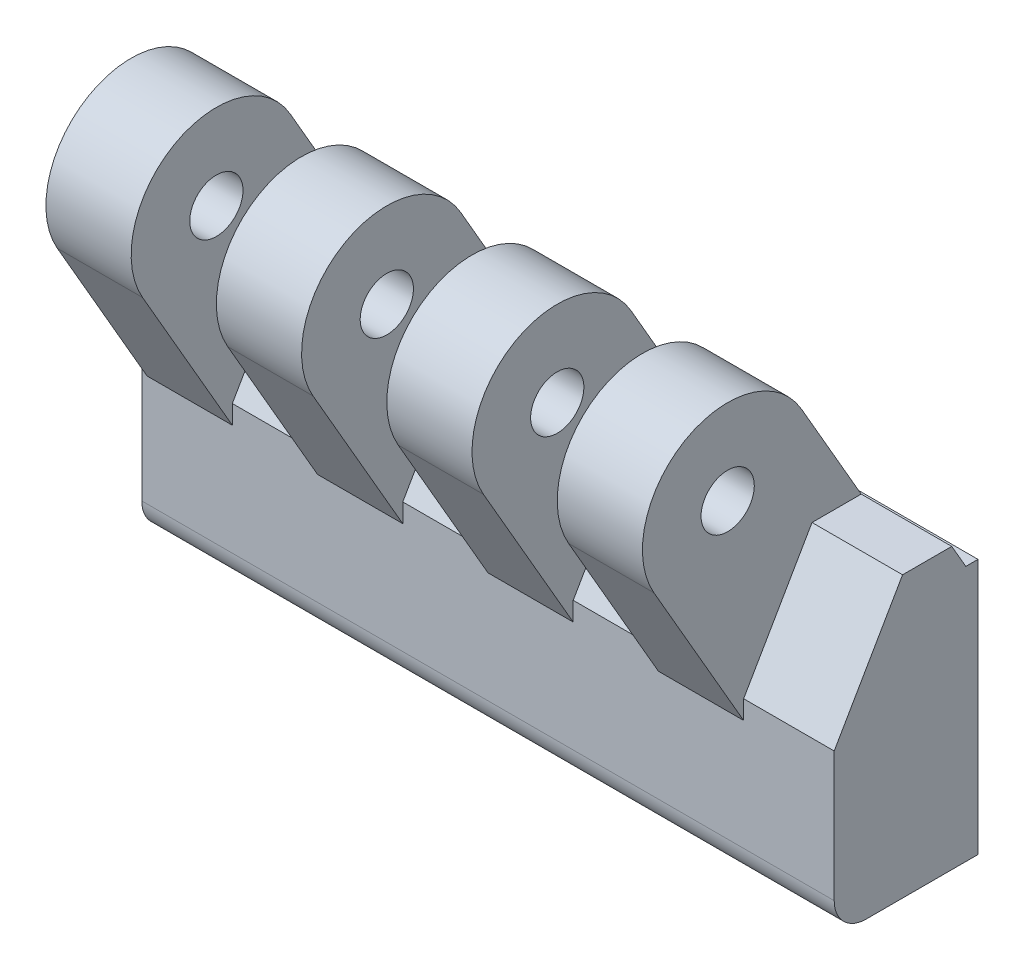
ISO-10303-21;
HEADER;
FILE_DESCRIPTION(('STEP AP214'),'2;1');
FILE_NAME('part.step','',(''),(''),'','','');
FILE_SCHEMA(('AUTOMOTIVE_DESIGN { 1 0 10303 214 1 1 1 1 }'));
ENDSEC;
DATA;
#1=APPLICATION_CONTEXT('core data for automotive mechanical design processes');
#2=APPLICATION_PROTOCOL_DEFINITION('international standard','automotive_design',2000,#1);
#3=PRODUCT_CONTEXT('',#1,'mechanical');
#4=PRODUCT('Part','Part','',(#3));
#5=PRODUCT_RELATED_PRODUCT_CATEGORY('part','',(#4));
#6=PRODUCT_DEFINITION_FORMATION('','',#4);
#7=PRODUCT_DEFINITION_CONTEXT('part definition',#1,'design');
#8=PRODUCT_DEFINITION('design','',#6,#7);
#9=PRODUCT_DEFINITION_SHAPE('','',#8);
#10=(LENGTH_UNIT() NAMED_UNIT(*) SI_UNIT(.MILLI.,.METRE.));
#11=(NAMED_UNIT(*) PLANE_ANGLE_UNIT() SI_UNIT($,.RADIAN.));
#12=(NAMED_UNIT(*) SI_UNIT($,.STERADIAN.) SOLID_ANGLE_UNIT());
#13=UNCERTAINTY_MEASURE_WITH_UNIT(LENGTH_MEASURE(1.E-05),#10,'distance_accuracy_value','');
#14=(GEOMETRIC_REPRESENTATION_CONTEXT(3) GLOBAL_UNCERTAINTY_ASSIGNED_CONTEXT((#13)) GLOBAL_UNIT_ASSIGNED_CONTEXT((#10,
#11,#12)) REPRESENTATION_CONTEXT('',''));
#15=CARTESIAN_POINT('',(0.,0.,0.));
#16=DIRECTION('',(0.,0.,1.));
#17=DIRECTION('',(1.,0.,0.));
#18=AXIS2_PLACEMENT_3D('',#15,#16,#17);
#19=CARTESIAN_POINT('',(-12.5,14.2857142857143,2.4632512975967));
#20=DIRECTION('',(0.,1.,0.));
#21=DIRECTION('',(-1.,0.,0.));
#22=AXIS2_PLACEMENT_3D('',#19,#20,#21);
#23=PLANE('',#22);
#24=DIRECTION('',(1.,0.,0.));
#25=VECTOR('',#24,1.);
#26=CARTESIAN_POINT('',(-12.5,14.2857142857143,7.0820534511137));
#27=LINE('',#26,#25);
#28=CARTESIAN_POINT('',(28.,14.2857142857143,7.0820534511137));
#29=VERTEX_POINT('',#28);
#30=CARTESIAN_POINT('',(36.,14.2857142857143,7.0820534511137));
#31=VERTEX_POINT('',#30);
#32=EDGE_CURVE('E471',#29,#31,#27,.T.);
#33=ORIENTED_EDGE('',*,*,#32,.T.);
#34=DIRECTION('',(0.,0.,-1.));
#35=VECTOR('',#34,1.);
#36=CARTESIAN_POINT('',(36.,14.2857142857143,2.4632512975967));
#37=LINE('',#36,#35);
#38=CARTESIAN_POINT('',(36.,14.2857142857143,2.46325129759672));
#39=VERTEX_POINT('',#38);
#40=EDGE_CURVE('E29',#31,#39,#37,.T.);
#41=ORIENTED_EDGE('',*,*,#40,.T.);
#42=DIRECTION('',(1.,0.,0.));
#43=VECTOR('',#42,1.);
#44=CARTESIAN_POINT('',(-12.5,14.2857142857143,2.4632512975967));
#45=LINE('',#44,#43);
#46=CARTESIAN_POINT('',(28.,14.2857142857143,2.46325129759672));
#47=VERTEX_POINT('',#46);
#48=EDGE_CURVE('E232',#47,#39,#45,.T.);
#49=ORIENTED_EDGE('',*,*,#48,.F.);
#50=DIRECTION('',(0.,0.,-1.));
#51=VECTOR('',#50,1.);
#52=CARTESIAN_POINT('',(28.,14.2857142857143,2.4632512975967));
#53=LINE('',#52,#51);
#54=EDGE_CURVE('E405',#29,#47,#53,.T.);
#55=ORIENTED_EDGE('',*,*,#54,.F.);
#56=EDGE_LOOP('',(#33,#41,#49,#55));
#57=FACE_BOUND('',#56,.T.);
#58=ADVANCED_FACE('F14',(#57),#23,.T.);
#59=CARTESIAN_POINT('',(-12.5,14.2857142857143,7.0820534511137));
#60=DIRECTION('',(0.,0.5,0.866025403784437));
#61=DIRECTION('',(0.,-0.866025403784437,0.5));
#62=AXIS2_PLACEMENT_3D('',#59,#60,#61);
#63=PLANE('',#62);
#64=DIRECTION('',(1.,0.,0.));
#65=VECTOR('',#64,1.);
#66=CARTESIAN_POINT('',(-12.5,3.169504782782,13.5));
#67=LINE('',#66,#65);
#68=CARTESIAN_POINT('',(28.,3.169504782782,13.5));
#69=VERTEX_POINT('',#68);
#70=CARTESIAN_POINT('',(36.,3.169504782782,13.5));
#71=VERTEX_POINT('',#70);
#72=EDGE_CURVE('E465',#69,#71,#67,.T.);
#73=ORIENTED_EDGE('',*,*,#72,.T.);
#74=DIRECTION('',(0.,0.866025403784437,-0.5));
#75=VECTOR('',#74,1.);
#76=CARTESIAN_POINT('',(36.,14.2857142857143,7.0820534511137));
#77=LINE('',#76,#75);
#78=EDGE_CURVE('E502',#71,#31,#77,.T.);
#79=ORIENTED_EDGE('',*,*,#78,.T.);
#80=ORIENTED_EDGE('',*,*,#32,.F.);
#81=DIRECTION('',(0.,0.866025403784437,-0.5));
#82=VECTOR('',#81,1.);
#83=CARTESIAN_POINT('',(28.,14.2857142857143,7.0820534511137));
#84=LINE('',#83,#82);
#85=EDGE_CURVE('E403',#69,#29,#84,.T.);
#86=ORIENTED_EDGE('',*,*,#85,.F.);
#87=EDGE_LOOP('',(#73,#79,#80,#86));
#88=FACE_BOUND('',#87,.T.);
#89=ADVANCED_FACE('F616',(#88),#63,.T.);
#90=CARTESIAN_POINT('',(-12.5,14.2857142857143,7.0820534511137));
#91=VERTEX_POINT('',#90);
#92=CARTESIAN_POINT('',(-12.,14.2857142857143,7.0820534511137));
#93=VERTEX_POINT('',#92);
#94=EDGE_CURVE('E466',#91,#93,#27,.T.);
#95=ORIENTED_EDGE('',*,*,#94,.T.);
#96=DIRECTION('',(0.,0.,-1.));
#97=VECTOR('',#96,1.);
#98=CARTESIAN_POINT('',(-12.,14.2857142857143,2.4632512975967));
#99=LINE('',#98,#97);
#100=CARTESIAN_POINT('',(-12.,14.2857142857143,2.4632512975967));
#101=VERTEX_POINT('',#100);
#102=EDGE_CURVE('E322',#93,#101,#99,.T.);
#103=ORIENTED_EDGE('',*,*,#102,.T.);
#104=CARTESIAN_POINT('',(-12.5,14.2857142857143,2.4632512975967));
#105=VERTEX_POINT('',#104);
#106=EDGE_CURVE('E472',#105,#101,#45,.T.);
#107=ORIENTED_EDGE('',*,*,#106,.F.);
#108=DIRECTION('',(0.,0.,1.));
#109=VECTOR('',#108,1.);
#110=CARTESIAN_POINT('',(-12.5,14.2857142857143,2.4632512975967));
#111=LINE('',#110,#109);
#112=EDGE_CURVE('E441',#105,#91,#111,.T.);
#113=ORIENTED_EDGE('',*,*,#112,.T.);
#114=EDGE_LOOP('',(#95,#103,#107,#113));
#115=FACE_BOUND('',#114,.T.);
#116=ADVANCED_FACE('F600',(#115),#23,.T.);
#117=CARTESIAN_POINT('',(-12.5,3.169504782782,13.5));
#118=VERTEX_POINT('',#117);
#119=CARTESIAN_POINT('',(-12.,3.169504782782,13.5));
#120=VERTEX_POINT('',#119);
#121=EDGE_CURVE('E460',#118,#120,#67,.T.);
#122=ORIENTED_EDGE('',*,*,#121,.T.);
#123=DIRECTION('',(0.,0.866025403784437,-0.5));
#124=VECTOR('',#123,1.);
#125=CARTESIAN_POINT('',(-12.,14.2857142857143,7.0820534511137));
#126=LINE('',#125,#124);
#127=EDGE_CURVE('E320',#120,#93,#126,.T.);
#128=ORIENTED_EDGE('',*,*,#127,.T.);
#129=ORIENTED_EDGE('',*,*,#94,.F.);
#130=DIRECTION('',(0.,-0.866025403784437,0.5));
#131=VECTOR('',#130,1.);
#132=CARTESIAN_POINT('',(-12.5,14.2857142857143,7.0820534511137));
#133=LINE('',#132,#131);
#134=EDGE_CURVE('E444',#91,#118,#133,.T.);
#135=ORIENTED_EDGE('',*,*,#134,.T.);
#136=EDGE_LOOP('',(#122,#128,#129,#135));
#137=FACE_BOUND('',#136,.T.);
#138=ADVANCED_FACE('F598',(#137),#63,.T.);
#139=CARTESIAN_POINT('',(-12.5,3.169504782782,13.5));
#140=DIRECTION('',(0.,0.,1.));
#141=DIRECTION('',(1.,0.,0.));
#142=AXIS2_PLACEMENT_3D('',#139,#140,#141);
#143=PLANE('',#142);
#144=DIRECTION('',(0.,1.,0.));
#145=VECTOR('',#144,1.);
#146=CARTESIAN_POINT('',(44.,3.169504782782,13.5));
#147=LINE('',#146,#145);
#148=CARTESIAN_POINT('',(44.,1.4019237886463,13.5));
#149=VERTEX_POINT('',#148);
#150=CARTESIAN_POINT('',(44.,3.169504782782,13.5));
#151=VERTEX_POINT('',#150);
#152=EDGE_CURVE('E278',#149,#151,#147,.T.);
#153=ORIENTED_EDGE('',*,*,#152,.F.);
#154=DIRECTION('',(-1.,0.,0.));
#155=VECTOR('',#154,1.);
#156=CARTESIAN_POINT('',(-12.5,1.4019237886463,13.5));
#157=LINE('',#156,#155);
#158=CARTESIAN_POINT('',(36.,1.4019237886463,13.5));
#159=VERTEX_POINT('',#158);
#160=EDGE_CURVE('E9',#149,#159,#157,.T.);
#161=ORIENTED_EDGE('',*,*,#160,.T.);
#162=DIRECTION('',(0.,1.,0.));
#163=VECTOR('',#162,1.);
#164=CARTESIAN_POINT('',(36.,3.169504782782,13.5));
#165=LINE('',#164,#163);
#166=EDGE_CURVE('E273',#159,#71,#165,.T.);
#167=ORIENTED_EDGE('',*,*,#166,.T.);
#168=ORIENTED_EDGE('',*,*,#72,.F.);
#169=DIRECTION('',(0.,1.,0.));
#170=VECTOR('',#169,1.);
#171=CARTESIAN_POINT('',(28.,3.169504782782,13.5));
#172=LINE('',#171,#170);
#173=CARTESIAN_POINT('',(28.,1.4019237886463,13.5));
#174=VERTEX_POINT('',#173);
#175=EDGE_CURVE('E488',#174,#69,#172,.T.);
#176=ORIENTED_EDGE('',*,*,#175,.F.);
#177=DIRECTION('',(-1.,0.,0.));
#178=VECTOR('',#177,1.);
#179=CARTESIAN_POINT('',(-12.5,1.4019237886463,13.5));
#180=LINE('',#179,#178);
#181=CARTESIAN_POINT('',(20.,1.4019237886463,13.5));
#182=VERTEX_POINT('',#181);
#183=EDGE_CURVE('E485',#174,#182,#180,.T.);
#184=ORIENTED_EDGE('',*,*,#183,.T.);
#185=DIRECTION('',(0.,1.,0.));
#186=VECTOR('',#185,1.);
#187=CARTESIAN_POINT('',(20.,3.169504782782,13.5));
#188=LINE('',#187,#186);
#189=CARTESIAN_POINT('',(20.,3.169504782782,13.5));
#190=VERTEX_POINT('',#189);
#191=EDGE_CURVE('E482',#182,#190,#188,.T.);
#192=ORIENTED_EDGE('',*,*,#191,.T.);
#193=CARTESIAN_POINT('',(12.,3.169504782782,13.5));
#194=VERTEX_POINT('',#193);
#195=EDGE_CURVE('E533',#194,#190,#67,.T.);
#196=ORIENTED_EDGE('',*,*,#195,.F.);
#197=DIRECTION('',(0.,1.,0.));
#198=VECTOR('',#197,1.);
#199=CARTESIAN_POINT('',(12.,3.169504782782,13.5));
#200=LINE('',#199,#198);
#201=CARTESIAN_POINT('',(12.,1.4019237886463,13.5));
#202=VERTEX_POINT('',#201);
#203=EDGE_CURVE('E490',#202,#194,#200,.T.);
#204=ORIENTED_EDGE('',*,*,#203,.F.);
#205=DIRECTION('',(1.,0.,0.));
#206=VECTOR('',#205,1.);
#207=CARTESIAN_POINT('',(-12.5,1.4019237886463,13.5));
#208=LINE('',#207,#206);
#209=CARTESIAN_POINT('',(4.,1.4019237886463,13.5));
#210=VERTEX_POINT('',#209);
#211=EDGE_CURVE('E493',#210,#202,#208,.T.);
#212=ORIENTED_EDGE('',*,*,#211,.F.);
#213=DIRECTION('',(0.,1.,0.));
#214=VECTOR('',#213,1.);
#215=CARTESIAN_POINT('',(4.,3.169504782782,13.5));
#216=LINE('',#215,#214);
#217=CARTESIAN_POINT('',(4.,3.169504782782,13.5));
#218=VERTEX_POINT('',#217);
#219=EDGE_CURVE('E496',#210,#218,#216,.T.);
#220=ORIENTED_EDGE('',*,*,#219,.T.);
#221=CARTESIAN_POINT('',(-4.,3.169504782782,13.5));
#222=VERTEX_POINT('',#221);
#223=EDGE_CURVE('E464',#222,#218,#67,.T.);
#224=ORIENTED_EDGE('',*,*,#223,.F.);
#225=DIRECTION('',(0.,1.,0.));
#226=VECTOR('',#225,1.);
#227=CARTESIAN_POINT('',(-4.,3.169504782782,13.5));
#228=LINE('',#227,#226);
#229=CARTESIAN_POINT('',(-4.,1.4019237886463,13.5));
#230=VERTEX_POINT('',#229);
#231=EDGE_CURVE('E311',#230,#222,#228,.T.);
#232=ORIENTED_EDGE('',*,*,#231,.F.);
#233=DIRECTION('',(1.,0.,0.));
#234=VECTOR('',#233,1.);
#235=CARTESIAN_POINT('',(-12.5,1.4019237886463,13.5));
#236=LINE('',#235,#234);
#237=CARTESIAN_POINT('',(-12.,1.4019237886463,13.5));
#238=VERTEX_POINT('',#237);
#239=EDGE_CURVE('E499',#238,#230,#236,.T.);
#240=ORIENTED_EDGE('',*,*,#239,.F.);
#241=DIRECTION('',(0.,1.,0.));
#242=VECTOR('',#241,1.);
#243=CARTESIAN_POINT('',(-12.,3.169504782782,13.5));
#244=LINE('',#243,#242);
#245=EDGE_CURVE('E318',#238,#120,#244,.T.);
#246=ORIENTED_EDGE('',*,*,#245,.T.);
#247=ORIENTED_EDGE('',*,*,#121,.F.);
#248=DIRECTION('',(0.,-1.,0.));
#249=VECTOR('',#248,1.);
#250=CARTESIAN_POINT('',(-12.5,3.169504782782,13.5));
#251=LINE('',#250,#249);
#252=CARTESIAN_POINT('',(-12.5,-9.,13.5));
#253=VERTEX_POINT('',#252);
#254=EDGE_CURVE('E447',#118,#253,#251,.T.);
#255=ORIENTED_EDGE('',*,*,#254,.T.);
#256=DIRECTION('',(1.,0.,0.));
#257=VECTOR('',#256,1.);
#258=CARTESIAN_POINT('',(-12.5,-9.,13.5));
#259=LINE('',#258,#257);
#260=CARTESIAN_POINT('',(52.5,-9.,13.5));
#261=VERTEX_POINT('',#260);
#262=EDGE_CURVE('E457',#253,#261,#259,.T.);
#263=ORIENTED_EDGE('',*,*,#262,.T.);
#264=DIRECTION('',(0.,-1.,0.));
#265=VECTOR('',#264,1.);
#266=CARTESIAN_POINT('',(52.5,3.169504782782,13.5));
#267=LINE('',#266,#265);
#268=CARTESIAN_POINT('',(52.5,3.169504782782,13.5));
#269=VERTEX_POINT('',#268);
#270=EDGE_CURVE('E423',#269,#261,#267,.T.);
#271=ORIENTED_EDGE('',*,*,#270,.F.);
#272=EDGE_CURVE('E459',#151,#269,#67,.T.);
#273=ORIENTED_EDGE('',*,*,#272,.F.);
#274=EDGE_LOOP('',(#153,#161,#167,#168,#176,#184,#192,#196,#204,#212,#220,#224,#232,#240,#246,
#247,#255,#263,#271,#273));
#275=FACE_BOUND('',#274,.T.);
#276=ADVANCED_FACE('F543',(#275),#143,.T.);
#277=DIRECTION('',(0.,0.,-1.));
#278=VECTOR('',#277,1.);
#279=CARTESIAN_POINT('',(-4.,14.2857142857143,2.4632512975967));
#280=LINE('',#279,#278);
#281=CARTESIAN_POINT('',(-4.,14.2857142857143,7.0820534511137));
#282=VERTEX_POINT('',#281);
#283=CARTESIAN_POINT('',(-4.,14.2857142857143,2.4632512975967));
#284=VERTEX_POINT('',#283);
#285=EDGE_CURVE('E37',#282,#284,#280,.T.);
#286=ORIENTED_EDGE('',*,*,#285,.F.);
#287=CARTESIAN_POINT('',(4.,14.2857142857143,7.0820534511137));
#288=VERTEX_POINT('',#287);
#289=EDGE_CURVE('E470',#282,#288,#27,.T.);
#290=ORIENTED_EDGE('',*,*,#289,.T.);
#291=DIRECTION('',(0.,0.,-1.));
#292=VECTOR('',#291,1.);
#293=CARTESIAN_POINT('',(4.,14.2857142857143,2.4632512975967));
#294=LINE('',#293,#292);
#295=CARTESIAN_POINT('',(4.,14.2857142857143,2.4632512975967));
#296=VERTEX_POINT('',#295);
#297=EDGE_CURVE('E364',#288,#296,#294,.T.);
#298=ORIENTED_EDGE('',*,*,#297,.T.);
#299=EDGE_CURVE('E476',#284,#296,#45,.T.);
#300=ORIENTED_EDGE('',*,*,#299,.F.);
#301=EDGE_LOOP('',(#286,#290,#298,#300));
#302=FACE_BOUND('',#301,.T.);
#303=ADVANCED_FACE('F626',(#302),#23,.T.);
#304=DIRECTION('',(0.,0.866025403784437,-0.5));
#305=VECTOR('',#304,1.);
#306=CARTESIAN_POINT('',(-4.,14.2857142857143,7.0820534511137));
#307=LINE('',#306,#305);
#308=EDGE_CURVE('E314',#222,#282,#307,.T.);
#309=ORIENTED_EDGE('',*,*,#308,.F.);
#310=ORIENTED_EDGE('',*,*,#223,.T.);
#311=DIRECTION('',(0.,0.866025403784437,-0.5));
#312=VECTOR('',#311,1.);
#313=CARTESIAN_POINT('',(4.,14.2857142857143,7.0820534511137));
#314=LINE('',#313,#312);
#315=EDGE_CURVE('E361',#218,#288,#314,.T.);
#316=ORIENTED_EDGE('',*,*,#315,.T.);
#317=ORIENTED_EDGE('',*,*,#289,.F.);
#318=EDGE_LOOP('',(#309,#310,#316,#317));
#319=FACE_BOUND('',#318,.T.);
#320=ADVANCED_FACE('F581',(#319),#63,.T.);
#321=DIRECTION('',(0.,0.,-1.));
#322=VECTOR('',#321,1.);
#323=CARTESIAN_POINT('',(12.,14.2857142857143,2.4632512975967));
#324=LINE('',#323,#322);
#325=CARTESIAN_POINT('',(12.,14.2857142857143,7.0820534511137));
#326=VERTEX_POINT('',#325);
#327=CARTESIAN_POINT('',(12.,14.2857142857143,2.4632512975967));
#328=VERTEX_POINT('',#327);
#329=EDGE_CURVE('E358',#326,#328,#324,.T.);
#330=ORIENTED_EDGE('',*,*,#329,.F.);
#331=CARTESIAN_POINT('',(20.,14.2857142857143,7.0820534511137));
#332=VERTEX_POINT('',#331);
#333=EDGE_CURVE('E519',#326,#332,#27,.T.);
#334=ORIENTED_EDGE('',*,*,#333,.T.);
#335=DIRECTION('',(0.,0.,-1.));
#336=VECTOR('',#335,1.);
#337=CARTESIAN_POINT('',(20.,14.2857142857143,2.4632512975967));
#338=LINE('',#337,#336);
#339=CARTESIAN_POINT('',(20.,14.2857142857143,2.46325129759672));
#340=VERTEX_POINT('',#339);
#341=EDGE_CURVE('E400',#332,#340,#338,.T.);
#342=ORIENTED_EDGE('',*,*,#341,.T.);
#343=EDGE_CURVE('E561',#328,#340,#45,.T.);
#344=ORIENTED_EDGE('',*,*,#343,.F.);
#345=EDGE_LOOP('',(#330,#334,#342,#344));
#346=FACE_BOUND('',#345,.T.);
#347=ADVANCED_FACE('F523',(#346),#23,.T.);
#348=DIRECTION('',(0.,0.866025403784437,-0.5));
#349=VECTOR('',#348,1.);
#350=CARTESIAN_POINT('',(12.,14.2857142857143,7.0820534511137));
#351=LINE('',#350,#349);
#352=EDGE_CURVE('E355',#194,#326,#351,.T.);
#353=ORIENTED_EDGE('',*,*,#352,.F.);
#354=ORIENTED_EDGE('',*,*,#195,.T.);
#355=DIRECTION('',(0.,0.866025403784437,-0.5));
#356=VECTOR('',#355,1.);
#357=CARTESIAN_POINT('',(20.,14.2857142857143,7.0820534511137));
#358=LINE('',#357,#356);
#359=EDGE_CURVE('E397',#190,#332,#358,.T.);
#360=ORIENTED_EDGE('',*,*,#359,.T.);
#361=ORIENTED_EDGE('',*,*,#333,.F.);
#362=EDGE_LOOP('',(#353,#354,#360,#361));
#363=FACE_BOUND('',#362,.T.);
#364=ADVANCED_FACE('F532',(#363),#63,.T.);
#365=CARTESIAN_POINT('',(-12.5,-12.,10.5));
#366=DIRECTION('',(0.,-1.,0.));
#367=DIRECTION('',(1.,0.,0.));
#368=AXIS2_PLACEMENT_3D('',#365,#366,#367);
#369=PLANE('',#368);
#370=DIRECTION('',(1.,0.,0.));
#371=VECTOR('',#370,1.);
#372=CARTESIAN_POINT('',(-12.5,-12.,0.));
#373=LINE('',#372,#371);
#374=CARTESIAN_POINT('',(-12.5,-12.,0.));
#375=VERTEX_POINT('',#374);
#376=CARTESIAN_POINT('',(52.5,-12.,0.));
#377=VERTEX_POINT('',#376);
#378=EDGE_CURVE('E480',#375,#377,#373,.T.);
#379=ORIENTED_EDGE('',*,*,#378,.T.);
#380=DIRECTION('',(0.,0.,-1.));
#381=VECTOR('',#380,1.);
#382=CARTESIAN_POINT('',(52.5,-12.,10.5));
#383=LINE('',#382,#381);
#384=CARTESIAN_POINT('',(52.5,-12.,10.5));
#385=VERTEX_POINT('',#384);
#386=EDGE_CURVE('E407',#385,#377,#383,.T.);
#387=ORIENTED_EDGE('',*,*,#386,.F.);
#388=DIRECTION('',(1.,0.,0.));
#389=VECTOR('',#388,1.);
#390=CARTESIAN_POINT('',(-12.5,-12.,10.5));
#391=LINE('',#390,#389);
#392=CARTESIAN_POINT('',(-12.5,-12.,10.5));
#393=VERTEX_POINT('',#392);
#394=EDGE_CURVE('E453',#393,#385,#391,.T.);
#395=ORIENTED_EDGE('',*,*,#394,.F.);
#396=DIRECTION('',(0.,0.,-1.));
#397=VECTOR('',#396,1.);
#398=CARTESIAN_POINT('',(-12.5,-12.,10.5));
#399=LINE('',#398,#397);
#400=EDGE_CURVE('E429',#393,#375,#399,.T.);
#401=ORIENTED_EDGE('',*,*,#400,.T.);
#402=EDGE_LOOP('',(#379,#387,#395,#401));
#403=FACE_BOUND('',#402,.T.);
#404=ADVANCED_FACE('F16',(#403),#369,.T.);
#405=CARTESIAN_POINT('',(-12.5,-12.,0.));
#406=DIRECTION('',(0.,0.,-1.));
#407=DIRECTION('',(-1.,0.,0.));
#408=AXIS2_PLACEMENT_3D('',#405,#406,#407);
#409=PLANE('',#408);
#410=CARTESIAN_POINT('',(0.,0.,0.));
#411=DIRECTION('',(0.,0.,-1.));
#412=DIRECTION('',(-1.,0.,0.));
#413=AXIS2_PLACEMENT_3D('',#410,#411,#412);
#414=CIRCLE('',#413,3.);
#415=CARTESIAN_POINT('',(-3.,0.,0.));
#416=VERTEX_POINT('',#415);
#417=EDGE_CURVE('E1347',#416,#416,#414,.T.);
#418=ORIENTED_EDGE('',*,*,#417,.F.);
#419=EDGE_LOOP('',(#418));
#420=FACE_BOUND('',#419,.T.);
#421=CARTESIAN_POINT('',(40.,0.,0.));
#422=DIRECTION('',(0.,0.,-1.));
#423=DIRECTION('',(-1.,0.,0.));
#424=AXIS2_PLACEMENT_3D('',#421,#422,#423);
#425=CIRCLE('',#424,3.);
#426=CARTESIAN_POINT('',(37.,0.,0.));
#427=VERTEX_POINT('',#426);
#428=EDGE_CURVE('E1350',#427,#427,#425,.T.);
#429=ORIENTED_EDGE('',*,*,#428,.F.);
#430=EDGE_LOOP('',(#429));
#431=FACE_BOUND('',#430,.T.);
#432=DIRECTION('',(1.,0.,0.));
#433=VECTOR('',#432,1.);
#434=CARTESIAN_POINT('',(-12.5,12.,0.));
#435=LINE('',#434,#433);
#436=CARTESIAN_POINT('',(-12.5,12.,0.));
#437=VERTEX_POINT('',#436);
#438=CARTESIAN_POINT('',(52.5,12.,0.));
#439=VERTEX_POINT('',#438);
#440=EDGE_CURVE('E478',#437,#439,#435,.T.);
#441=ORIENTED_EDGE('',*,*,#440,.T.);
#442=DIRECTION('',(0.,1.,0.));
#443=VECTOR('',#442,1.);
#444=CARTESIAN_POINT('',(52.5,-12.,0.));
#445=LINE('',#444,#443);
#446=EDGE_CURVE('E408',#377,#439,#445,.T.);
#447=ORIENTED_EDGE('',*,*,#446,.F.);
#448=ORIENTED_EDGE('',*,*,#378,.F.);
#449=DIRECTION('',(0.,1.,0.));
#450=VECTOR('',#449,1.);
#451=CARTESIAN_POINT('',(-12.5,-12.,0.));
#452=LINE('',#451,#450);
#453=EDGE_CURVE('E432',#375,#437,#452,.T.);
#454=ORIENTED_EDGE('',*,*,#453,.T.);
#455=EDGE_LOOP('',(#441,#447,#448,#454));
#456=FACE_BOUND('',#455,.T.);
#457=ADVANCED_FACE('F554',(#420,#431,#456),#409,.T.);
#458=CARTESIAN_POINT('',(-12.5,12.,0.));
#459=DIRECTION('',(0.,1.,0.));
#460=DIRECTION('',(-1.,0.,0.));
#461=AXIS2_PLACEMENT_3D('',#458,#459,#460);
#462=PLANE('',#461);
#463=DIRECTION('',(1.,0.,0.));
#464=VECTOR('',#463,1.);
#465=CARTESIAN_POINT('',(-12.5,12.,1.143593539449));
#466=LINE('',#465,#464);
#467=CARTESIAN_POINT('',(-12.5,12.,1.143593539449));
#468=VERTEX_POINT('',#467);
#469=CARTESIAN_POINT('',(52.5,12.,1.143593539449));
#470=VERTEX_POINT('',#469);
#471=EDGE_CURVE('E475',#468,#470,#466,.T.);
#472=ORIENTED_EDGE('',*,*,#471,.T.);
#473=DIRECTION('',(0.,0.,1.));
#474=VECTOR('',#473,1.);
#475=CARTESIAN_POINT('',(52.5,12.,0.));
#476=LINE('',#475,#474);
#477=EDGE_CURVE('E411',#439,#470,#476,.T.);
#478=ORIENTED_EDGE('',*,*,#477,.F.);
#479=ORIENTED_EDGE('',*,*,#440,.F.);
#480=DIRECTION('',(0.,0.,1.));
#481=VECTOR('',#480,1.);
#482=CARTESIAN_POINT('',(-12.5,12.,0.));
#483=LINE('',#482,#481);
#484=EDGE_CURVE('E435',#437,#468,#483,.T.);
#485=ORIENTED_EDGE('',*,*,#484,.T.);
#486=EDGE_LOOP('',(#472,#478,#479,#485));
#487=FACE_BOUND('',#486,.T.);
#488=ADVANCED_FACE('F557',(#487),#462,.T.);
#489=CARTESIAN_POINT('',(-12.5,12.,1.143593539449));
#490=DIRECTION('',(0.,0.499999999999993,-0.866025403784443));
#491=DIRECTION('',(0.,0.866025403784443,0.499999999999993));
#492=AXIS2_PLACEMENT_3D('',#489,#490,#491);
#493=PLANE('',#492);
#494=DIRECTION('',(0.,0.866025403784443,0.499999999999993));
#495=VECTOR('',#494,1.);
#496=CARTESIAN_POINT('',(52.5,12.,1.143593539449));
#497=LINE('',#496,#495);
#498=CARTESIAN_POINT('',(52.5,14.2857142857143,2.4632512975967));
#499=VERTEX_POINT('',#498);
#500=EDGE_CURVE('E414',#470,#499,#497,.T.);
#501=ORIENTED_EDGE('',*,*,#500,.F.);
#502=ORIENTED_EDGE('',*,*,#471,.F.);
#503=DIRECTION('',(0.,0.866025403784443,0.499999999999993));
#504=VECTOR('',#503,1.);
#505=CARTESIAN_POINT('',(-12.5,12.,1.143593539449));
#506=LINE('',#505,#504);
#507=EDGE_CURVE('E438',#468,#105,#506,.T.);
#508=ORIENTED_EDGE('',*,*,#507,.T.);
#509=ORIENTED_EDGE('',*,*,#106,.T.);
#510=DIRECTION('',(0.,0.866025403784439,0.5));
#511=VECTOR('',#510,1.);
#512=CARTESIAN_POINT('',(-12.,11.7512886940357,1.));
#513=LINE('',#512,#511);
#514=CARTESIAN_POINT('',(-12.,24.,8.0717967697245));
#515=VERTEX_POINT('',#514);
#516=EDGE_CURVE('E296',#101,#515,#513,.T.);
#517=ORIENTED_EDGE('',*,*,#516,.T.);
#518=DIRECTION('',(1.,0.,0.));
#519=VECTOR('',#518,1.);
#520=CARTESIAN_POINT('',(-12.,24.,8.0717967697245));
#521=LINE('',#520,#519);
#522=CARTESIAN_POINT('',(-4.,24.,8.0717967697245));
#523=VERTEX_POINT('',#522);
#524=EDGE_CURVE('E308',#515,#523,#521,.T.);
#525=ORIENTED_EDGE('',*,*,#524,.T.);
#526=DIRECTION('',(0.,0.866025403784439,0.5));
#527=VECTOR('',#526,1.);
#528=CARTESIAN_POINT('',(-4.,11.7512886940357,1.));
#529=LINE('',#528,#527);
#530=EDGE_CURVE('E281',#284,#523,#529,.T.);
#531=ORIENTED_EDGE('',*,*,#530,.F.);
#532=ORIENTED_EDGE('',*,*,#299,.T.);
#533=DIRECTION('',(0.,0.866025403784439,0.5));
#534=VECTOR('',#533,1.);
#535=CARTESIAN_POINT('',(4.,11.7512886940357,1.));
#536=LINE('',#535,#534);
#537=CARTESIAN_POINT('',(4.,24.,8.0717967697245));
#538=VERTEX_POINT('',#537);
#539=EDGE_CURVE('E340',#296,#538,#536,.T.);
#540=ORIENTED_EDGE('',*,*,#539,.T.);
#541=DIRECTION('',(1.,0.,0.));
#542=VECTOR('',#541,1.);
#543=CARTESIAN_POINT('',(4.,24.,8.0717967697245));
#544=LINE('',#543,#542);
#545=CARTESIAN_POINT('',(12.,24.,8.0717967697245));
#546=VERTEX_POINT('',#545);
#547=EDGE_CURVE('E352',#538,#546,#544,.T.);
#548=ORIENTED_EDGE('',*,*,#547,.T.);
#549=DIRECTION('',(0.,0.866025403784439,0.5));
#550=VECTOR('',#549,1.);
#551=CARTESIAN_POINT('',(12.,11.7512886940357,1.));
#552=LINE('',#551,#550);
#553=EDGE_CURVE('E325',#328,#546,#552,.T.);
#554=ORIENTED_EDGE('',*,*,#553,.F.);
#555=ORIENTED_EDGE('',*,*,#343,.T.);
#556=DIRECTION('',(0.,0.866025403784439,0.5));
#557=VECTOR('',#556,1.);
#558=CARTESIAN_POINT('',(20.,11.7512886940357,1.));
#559=LINE('',#558,#557);
#560=CARTESIAN_POINT('',(20.,24.,8.0717967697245));
#561=VERTEX_POINT('',#560);
#562=EDGE_CURVE('E368',#340,#561,#559,.T.);
#563=ORIENTED_EDGE('',*,*,#562,.T.);
#564=DIRECTION('',(-1.,0.,0.));
#565=VECTOR('',#564,1.);
#566=CARTESIAN_POINT('',(28.,24.,8.0717967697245));
#567=LINE('',#566,#565);
#568=CARTESIAN_POINT('',(28.,24.,8.0717967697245));
#569=VERTEX_POINT('',#568);
#570=EDGE_CURVE('E394',#569,#561,#567,.T.);
#571=ORIENTED_EDGE('',*,*,#570,.F.);
#572=DIRECTION('',(0.,0.866025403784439,0.5));
#573=VECTOR('',#572,1.);
#574=CARTESIAN_POINT('',(28.,11.7512886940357,1.));
#575=LINE('',#574,#573);
#576=EDGE_CURVE('E382',#47,#569,#575,.T.);
#577=ORIENTED_EDGE('',*,*,#576,.F.);
#578=ORIENTED_EDGE('',*,*,#48,.T.);
#579=DIRECTION('',(0.,0.866025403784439,0.5));
#580=VECTOR('',#579,1.);
#581=CARTESIAN_POINT('',(36.,11.7512886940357,1.));
#582=LINE('',#581,#580);
#583=CARTESIAN_POINT('',(36.,24.,8.0717967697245));
#584=VERTEX_POINT('',#583);
#585=EDGE_CURVE('E223',#39,#584,#582,.T.);
#586=ORIENTED_EDGE('',*,*,#585,.T.);
#587=DIRECTION('',(-1.,0.,0.));
#588=VECTOR('',#587,1.);
#589=CARTESIAN_POINT('',(44.,24.,8.0717967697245));
#590=LINE('',#589,#588);
#591=CARTESIAN_POINT('',(44.,24.,8.0717967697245));
#592=VERTEX_POINT('',#591);
#593=EDGE_CURVE('E228',#592,#584,#590,.T.);
#594=ORIENTED_EDGE('',*,*,#593,.F.);
#595=DIRECTION('',(0.,0.866025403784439,0.5));
#596=VECTOR('',#595,1.);
#597=CARTESIAN_POINT('',(44.,11.7512886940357,1.));
#598=LINE('',#597,#596);
#599=CARTESIAN_POINT('',(44.,14.2857142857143,2.46325129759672));
#600=VERTEX_POINT('',#599);
#601=EDGE_CURVE('E263',#600,#592,#598,.T.);
#602=ORIENTED_EDGE('',*,*,#601,.F.);
#603=EDGE_CURVE('E469',#600,#499,#45,.T.);
#604=ORIENTED_EDGE('',*,*,#603,.T.);
#605=EDGE_LOOP('',(#501,#502,#508,#509,#517,#525,#531,#532,#540,#548,#554,#555,#563,#571,#577,
#578,#586,#594,#602,#604));
#606=FACE_BOUND('',#605,.T.);
#607=ADVANCED_FACE('F226',(#606),#493,.T.);
#608=DIRECTION('',(0.,0.,-1.));
#609=VECTOR('',#608,1.);
#610=CARTESIAN_POINT('',(44.,14.2857142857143,2.4632512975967));
#611=LINE('',#610,#609);
#612=CARTESIAN_POINT('',(44.,14.2857142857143,7.0820534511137));
#613=VERTEX_POINT('',#612);
#614=EDGE_CURVE('E276',#613,#600,#611,.T.);
#615=ORIENTED_EDGE('',*,*,#614,.F.);
#616=CARTESIAN_POINT('',(52.5,14.2857142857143,7.0820534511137));
#617=VERTEX_POINT('',#616);
#618=EDGE_CURVE('E463',#613,#617,#27,.T.);
#619=ORIENTED_EDGE('',*,*,#618,.T.);
#620=DIRECTION('',(0.,0.,1.));
#621=VECTOR('',#620,1.);
#622=CARTESIAN_POINT('',(52.5,14.2857142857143,2.4632512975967));
#623=LINE('',#622,#621);
#624=EDGE_CURVE('E417',#499,#617,#623,.T.);
#625=ORIENTED_EDGE('',*,*,#624,.F.);
#626=ORIENTED_EDGE('',*,*,#603,.F.);
#627=EDGE_LOOP('',(#615,#619,#625,#626));
#628=FACE_BOUND('',#627,.T.);
#629=ADVANCED_FACE('F514',(#628),#23,.T.);
#630=DIRECTION('',(0.,0.866025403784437,-0.5));
#631=VECTOR('',#630,1.);
#632=CARTESIAN_POINT('',(44.,14.2857142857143,7.0820534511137));
#633=LINE('',#632,#631);
#634=EDGE_CURVE('E22',#151,#613,#633,.T.);
#635=ORIENTED_EDGE('',*,*,#634,.F.);
#636=ORIENTED_EDGE('',*,*,#272,.T.);
#637=DIRECTION('',(0.,-0.866025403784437,0.5));
#638=VECTOR('',#637,1.);
#639=CARTESIAN_POINT('',(52.5,14.2857142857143,7.0820534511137));
#640=LINE('',#639,#638);
#641=EDGE_CURVE('E420',#617,#269,#640,.T.);
#642=ORIENTED_EDGE('',*,*,#641,.F.);
#643=ORIENTED_EDGE('',*,*,#618,.F.);
#644=EDGE_LOOP('',(#635,#636,#642,#643));
#645=FACE_BOUND('',#644,.T.);
#646=ADVANCED_FACE('F517',(#645),#63,.T.);
#647=CARTESIAN_POINT('',(-12.5,-9.00000000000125,10.5000000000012));
#648=DIRECTION('',(1.,0.,0.));
#649=DIRECTION('',(0.,1.,0.));
#650=AXIS2_PLACEMENT_3D('',#647,#648,#649);
#651=CYLINDRICAL_SURFACE('',#650,2.99999999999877);
#652=ORIENTED_EDGE('',*,*,#394,.T.);
#653=CARTESIAN_POINT('',(52.5,-9.00000000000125,10.5000000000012));
#654=DIRECTION('',(1.,0.,0.));
#655=DIRECTION('',(0.,1.,0.));
#656=AXIS2_PLACEMENT_3D('',#653,#654,#655);
#657=CIRCLE('',#656,2.99999999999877);
#658=EDGE_CURVE('E426',#261,#385,#657,.T.);
#659=ORIENTED_EDGE('',*,*,#658,.F.);
#660=ORIENTED_EDGE('',*,*,#262,.F.);
#661=CARTESIAN_POINT('',(-12.5,-9.00000000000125,10.5000000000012));
#662=DIRECTION('',(1.,0.,0.));
#663=DIRECTION('',(0.,1.,0.));
#664=AXIS2_PLACEMENT_3D('',#661,#662,#663);
#665=CIRCLE('',#664,2.99999999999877);
#666=EDGE_CURVE('E450',#253,#393,#665,.T.);
#667=ORIENTED_EDGE('',*,*,#666,.T.);
#668=EDGE_LOOP('',(#652,#659,#660,#667));
#669=FACE_BOUND('',#668,.T.);
#670=ADVANCED_FACE('F547',(#669),#651,.T.);
#671=CARTESIAN_POINT('',(-12.5,-9.00000000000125,10.5000000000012));
#672=DIRECTION('',(1.,0.,0.));
#673=DIRECTION('',(0.,1.,0.));
#674=AXIS2_PLACEMENT_3D('',#671,#672,#673);
#675=PLANE('',#674);
#676=ORIENTED_EDGE('',*,*,#400,.F.);
#677=ORIENTED_EDGE('',*,*,#666,.F.);
#678=ORIENTED_EDGE('',*,*,#254,.F.);
#679=ORIENTED_EDGE('',*,*,#134,.F.);
#680=ORIENTED_EDGE('',*,*,#112,.F.);
#681=ORIENTED_EDGE('',*,*,#507,.F.);
#682=ORIENTED_EDGE('',*,*,#484,.F.);
#683=ORIENTED_EDGE('',*,*,#453,.F.);
#684=EDGE_LOOP('',(#676,#677,#678,#679,#680,#681,#682,#683));
#685=FACE_BOUND('',#684,.T.);
#686=ADVANCED_FACE('F603',(#685),#675,.F.);
#687=CARTESIAN_POINT('',(52.5,-9.00000000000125,10.5000000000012));
#688=DIRECTION('',(1.,0.,0.));
#689=DIRECTION('',(0.,1.,0.));
#690=AXIS2_PLACEMENT_3D('',#687,#688,#689);
#691=PLANE('',#690);
#692=ORIENTED_EDGE('',*,*,#386,.T.);
#693=ORIENTED_EDGE('',*,*,#446,.T.);
#694=ORIENTED_EDGE('',*,*,#477,.T.);
#695=ORIENTED_EDGE('',*,*,#500,.T.);
#696=ORIENTED_EDGE('',*,*,#624,.T.);
#697=ORIENTED_EDGE('',*,*,#641,.T.);
#698=ORIENTED_EDGE('',*,*,#270,.T.);
#699=ORIENTED_EDGE('',*,*,#658,.T.);
#700=EDGE_LOOP('',(#692,#693,#694,#695,#696,#697,#698,#699));
#701=FACE_BOUND('',#700,.T.);
#702=ADVANCED_FACE('F541',(#701),#691,.T.);
#703=CARTESIAN_POINT('',(28.,16.,21.928203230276));
#704=DIRECTION('',(0.,0.500000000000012,-0.866025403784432));
#705=DIRECTION('',(0.,0.866025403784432,0.500000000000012));
#706=AXIS2_PLACEMENT_3D('',#703,#704,#705);
#707=PLANE('',#706);
#708=ORIENTED_EDGE('',*,*,#183,.F.);
#709=DIRECTION('',(0.,-0.866025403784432,-0.500000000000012));
#710=VECTOR('',#709,1.);
#711=CARTESIAN_POINT('',(28.,16.,21.928203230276));
#712=LINE('',#711,#710);
#713=CARTESIAN_POINT('',(28.,16.,21.928203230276));
#714=VERTEX_POINT('',#713);
#715=EDGE_CURVE('E381',#714,#174,#712,.T.);
#716=ORIENTED_EDGE('',*,*,#715,.F.);
#717=DIRECTION('',(-1.,0.,0.));
#718=VECTOR('',#717,1.);
#719=CARTESIAN_POINT('',(28.,16.,21.928203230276));
#720=LINE('',#719,#718);
#721=CARTESIAN_POINT('',(20.,16.,21.928203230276));
#722=VERTEX_POINT('',#721);
#723=EDGE_CURVE('E391',#714,#722,#720,.T.);
#724=ORIENTED_EDGE('',*,*,#723,.T.);
#725=DIRECTION('',(0.,-0.866025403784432,-0.500000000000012));
#726=VECTOR('',#725,1.);
#727=CARTESIAN_POINT('',(20.,16.,21.928203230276));
#728=LINE('',#727,#726);
#729=EDGE_CURVE('E367',#722,#182,#728,.T.);
#730=ORIENTED_EDGE('',*,*,#729,.T.);
#731=EDGE_LOOP('',(#708,#716,#724,#730));
#732=FACE_BOUND('',#731,.T.);
#733=ADVANCED_FACE('F612',(#732),#707,.F.);
#734=CARTESIAN_POINT('',(28.,20.,15.));
#735=DIRECTION('',(-1.,0.,0.));
#736=DIRECTION('',(0.,-1.,0.));
#737=AXIS2_PLACEMENT_3D('',#734,#735,#736);
#738=CYLINDRICAL_SURFACE('',#737,2.5);
#739=CARTESIAN_POINT('',(28.,20.,15.));
#740=DIRECTION('',(1.,0.,0.));
#741=DIRECTION('',(0.,1.,0.));
#742=AXIS2_PLACEMENT_3D('',#739,#740,#741);
#743=CIRCLE('',#742,2.5);
#744=CARTESIAN_POINT('',(28.,22.5,15.));
#745=VERTEX_POINT('',#744);
#746=EDGE_CURVE('E386',#745,#745,#743,.T.);
#747=ORIENTED_EDGE('',*,*,#746,.T.);
#748=EDGE_LOOP('',(#747));
#749=FACE_BOUND('',#748,.T.);
#750=CARTESIAN_POINT('',(20.,20.,15.));
#751=DIRECTION('',(1.,0.,0.));
#752=DIRECTION('',(0.,1.,0.));
#753=AXIS2_PLACEMENT_3D('',#750,#751,#752);
#754=CIRCLE('',#753,2.5);
#755=CARTESIAN_POINT('',(20.,22.5,15.));
#756=VERTEX_POINT('',#755);
#757=EDGE_CURVE('E374',#756,#756,#754,.T.);
#758=ORIENTED_EDGE('',*,*,#757,.F.);
#759=EDGE_LOOP('',(#758));
#760=FACE_BOUND('',#759,.T.);
#761=ADVANCED_FACE('F718',(#749,#760),#738,.F.);
#762=CARTESIAN_POINT('',(28.,19.9999999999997,15.));
#763=DIRECTION('',(-1.,0.,0.));
#764=DIRECTION('',(0.,-1.,0.));
#765=AXIS2_PLACEMENT_3D('',#762,#763,#764);
#766=CYLINDRICAL_SURFACE('',#765,8.00000000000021);
#767=CARTESIAN_POINT('',(20.,19.9999999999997,15.));
#768=DIRECTION('',(1.,0.,0.));
#769=DIRECTION('',(0.,-1.,0.));
#770=AXIS2_PLACEMENT_3D('',#767,#768,#769);
#771=CIRCLE('',#770,8.00000000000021);
#772=EDGE_CURVE('E371',#561,#722,#771,.T.);
#773=ORIENTED_EDGE('',*,*,#772,.T.);
#774=ORIENTED_EDGE('',*,*,#723,.F.);
#775=CARTESIAN_POINT('',(28.,19.9999999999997,15.));
#776=DIRECTION('',(1.,0.,0.));
#777=DIRECTION('',(0.,-1.,0.));
#778=AXIS2_PLACEMENT_3D('',#775,#776,#777);
#779=CIRCLE('',#778,8.00000000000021);
#780=EDGE_CURVE('E384',#569,#714,#779,.T.);
#781=ORIENTED_EDGE('',*,*,#780,.F.);
#782=ORIENTED_EDGE('',*,*,#570,.T.);
#783=EDGE_LOOP('',(#773,#774,#781,#782));
#784=FACE_BOUND('',#783,.T.);
#785=ADVANCED_FACE('F730',(#784),#766,.T.);
#786=CARTESIAN_POINT('',(28.,19.9999999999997,15.));
#787=DIRECTION('',(1.,0.,0.));
#788=DIRECTION('',(0.,1.,0.));
#789=AXIS2_PLACEMENT_3D('',#786,#787,#788);
#790=PLANE('',#789);
#791=ORIENTED_EDGE('',*,*,#746,.F.);
#792=EDGE_LOOP('',(#791));
#793=FACE_BOUND('',#792,.T.);
#794=ORIENTED_EDGE('',*,*,#85,.T.);
#795=ORIENTED_EDGE('',*,*,#54,.T.);
#796=ORIENTED_EDGE('',*,*,#576,.T.);
#797=ORIENTED_EDGE('',*,*,#780,.T.);
#798=ORIENTED_EDGE('',*,*,#715,.T.);
#799=ORIENTED_EDGE('',*,*,#175,.T.);
#800=EDGE_LOOP('',(#794,#795,#796,#797,#798,#799));
#801=FACE_BOUND('',#800,.T.);
#802=ADVANCED_FACE('F742',(#793,#801),#790,.T.);
#803=CARTESIAN_POINT('',(20.,19.9999999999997,15.));
#804=DIRECTION('',(1.,0.,0.));
#805=DIRECTION('',(0.,1.,0.));
#806=AXIS2_PLACEMENT_3D('',#803,#804,#805);
#807=PLANE('',#806);
#808=ORIENTED_EDGE('',*,*,#341,.F.);
#809=ORIENTED_EDGE('',*,*,#359,.F.);
#810=ORIENTED_EDGE('',*,*,#191,.F.);
#811=ORIENTED_EDGE('',*,*,#729,.F.);
#812=ORIENTED_EDGE('',*,*,#772,.F.);
#813=ORIENTED_EDGE('',*,*,#562,.F.);
#814=EDGE_LOOP('',(#808,#809,#810,#811,#812,#813));
#815=FACE_BOUND('',#814,.T.);
#816=ORIENTED_EDGE('',*,*,#757,.T.);
#817=EDGE_LOOP('',(#816));
#818=FACE_BOUND('',#817,.T.);
#819=ADVANCED_FACE('F529',(#815,#818),#807,.F.);
#820=CARTESIAN_POINT('',(4.,16.,21.928203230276));
#821=DIRECTION('',(0.,-0.500000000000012,0.866025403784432));
#822=DIRECTION('',(0.,-0.866025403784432,-0.500000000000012));
#823=AXIS2_PLACEMENT_3D('',#820,#821,#822);
#824=PLANE('',#823);
#825=DIRECTION('',(0.,-0.866025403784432,-0.500000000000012));
#826=VECTOR('',#825,1.);
#827=CARTESIAN_POINT('',(4.,16.,21.928203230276));
#828=LINE('',#827,#826);
#829=CARTESIAN_POINT('',(4.,16.,21.928203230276));
#830=VERTEX_POINT('',#829);
#831=EDGE_CURVE('E339',#830,#210,#828,.T.);
#832=ORIENTED_EDGE('',*,*,#831,.T.);
#833=ORIENTED_EDGE('',*,*,#211,.T.);
#834=DIRECTION('',(0.,-0.866025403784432,-0.500000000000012));
#835=VECTOR('',#834,1.);
#836=CARTESIAN_POINT('',(12.,16.,21.928203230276));
#837=LINE('',#836,#835);
#838=CARTESIAN_POINT('',(12.,16.,21.928203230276));
#839=VERTEX_POINT('',#838);
#840=EDGE_CURVE('E324',#839,#202,#837,.T.);
#841=ORIENTED_EDGE('',*,*,#840,.F.);
#842=DIRECTION('',(1.,0.,0.));
#843=VECTOR('',#842,1.);
#844=CARTESIAN_POINT('',(4.,16.,21.928203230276));
#845=LINE('',#844,#843);
#846=EDGE_CURVE('E350',#830,#839,#845,.T.);
#847=ORIENTED_EDGE('',*,*,#846,.F.);
#848=EDGE_LOOP('',(#832,#833,#841,#847));
#849=FACE_BOUND('',#848,.T.);
#850=ADVANCED_FACE('F570',(#849),#824,.T.);
#851=CARTESIAN_POINT('',(4.,20.,15.));
#852=DIRECTION('',(1.,0.,0.));
#853=DIRECTION('',(0.,1.,0.));
#854=AXIS2_PLACEMENT_3D('',#851,#852,#853);
#855=CYLINDRICAL_SURFACE('',#854,2.5);
#856=CARTESIAN_POINT('',(4.,20.,15.));
#857=DIRECTION('',(1.,0.,0.));
#858=DIRECTION('',(0.,1.,0.));
#859=AXIS2_PLACEMENT_3D('',#856,#857,#858);
#860=CIRCLE('',#859,2.5);
#861=CARTESIAN_POINT('',(4.,22.5,15.));
#862=VERTEX_POINT('',#861);
#863=EDGE_CURVE('E345',#862,#862,#860,.T.);
#864=ORIENTED_EDGE('',*,*,#863,.F.);
#865=EDGE_LOOP('',(#864));
#866=FACE_BOUND('',#865,.T.);
#867=CARTESIAN_POINT('',(12.,20.,15.));
#868=DIRECTION('',(1.,0.,0.));
#869=DIRECTION('',(0.,1.,0.));
#870=AXIS2_PLACEMENT_3D('',#867,#868,#869);
#871=CIRCLE('',#870,2.5);
#872=CARTESIAN_POINT('',(12.,22.5,15.));
#873=VERTEX_POINT('',#872);
#874=EDGE_CURVE('E332',#873,#873,#871,.T.);
#875=ORIENTED_EDGE('',*,*,#874,.T.);
#876=EDGE_LOOP('',(#875));
#877=FACE_BOUND('',#876,.T.);
#878=ADVANCED_FACE('F775',(#866,#877),#855,.F.);
#879=CARTESIAN_POINT('',(4.,19.9999999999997,15.));
#880=DIRECTION('',(1.,0.,0.));
#881=DIRECTION('',(0.,1.,0.));
#882=AXIS2_PLACEMENT_3D('',#879,#880,#881);
#883=CYLINDRICAL_SURFACE('',#882,8.00000000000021);
#884=CARTESIAN_POINT('',(12.,19.9999999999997,15.));
#885=DIRECTION('',(1.,0.,0.));
#886=DIRECTION('',(0.,-1.,0.));
#887=AXIS2_PLACEMENT_3D('',#884,#885,#886);
#888=CIRCLE('',#887,8.00000000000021);
#889=EDGE_CURVE('E328',#546,#839,#888,.T.);
#890=ORIENTED_EDGE('',*,*,#889,.F.);
#891=ORIENTED_EDGE('',*,*,#547,.F.);
#892=CARTESIAN_POINT('',(4.,19.9999999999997,15.));
#893=DIRECTION('',(1.,0.,0.));
#894=DIRECTION('',(0.,-1.,0.));
#895=AXIS2_PLACEMENT_3D('',#892,#893,#894);
#896=CIRCLE('',#895,8.00000000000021);
#897=EDGE_CURVE('E342',#538,#830,#896,.T.);
#898=ORIENTED_EDGE('',*,*,#897,.T.);
#899=ORIENTED_EDGE('',*,*,#846,.T.);
#900=EDGE_LOOP('',(#890,#891,#898,#899));
#901=FACE_BOUND('',#900,.T.);
#902=ADVANCED_FACE('F786',(#901),#883,.T.);
#903=CARTESIAN_POINT('',(4.,19.9999999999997,15.));
#904=DIRECTION('',(1.,0.,0.));
#905=DIRECTION('',(0.,1.,0.));
#906=AXIS2_PLACEMENT_3D('',#903,#904,#905);
#907=PLANE('',#906);
#908=ORIENTED_EDGE('',*,*,#297,.F.);
#909=ORIENTED_EDGE('',*,*,#315,.F.);
#910=ORIENTED_EDGE('',*,*,#219,.F.);
#911=ORIENTED_EDGE('',*,*,#831,.F.);
#912=ORIENTED_EDGE('',*,*,#897,.F.);
#913=ORIENTED_EDGE('',*,*,#539,.F.);
#914=EDGE_LOOP('',(#908,#909,#910,#911,#912,#913));
#915=FACE_BOUND('',#914,.T.);
#916=ORIENTED_EDGE('',*,*,#863,.T.);
#917=EDGE_LOOP('',(#916));
#918=FACE_BOUND('',#917,.T.);
#919=ADVANCED_FACE('F575',(#915,#918),#907,.F.);
#920=CARTESIAN_POINT('',(12.,19.9999999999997,15.));
#921=DIRECTION('',(1.,0.,0.));
#922=DIRECTION('',(0.,1.,0.));
#923=AXIS2_PLACEMENT_3D('',#920,#921,#922);
#924=PLANE('',#923);
#925=ORIENTED_EDGE('',*,*,#874,.F.);
#926=EDGE_LOOP('',(#925));
#927=FACE_BOUND('',#926,.T.);
#928=ORIENTED_EDGE('',*,*,#352,.T.);
#929=ORIENTED_EDGE('',*,*,#329,.T.);
#930=ORIENTED_EDGE('',*,*,#553,.T.);
#931=ORIENTED_EDGE('',*,*,#889,.T.);
#932=ORIENTED_EDGE('',*,*,#840,.T.);
#933=ORIENTED_EDGE('',*,*,#203,.T.);
#934=EDGE_LOOP('',(#928,#929,#930,#931,#932,#933));
#935=FACE_BOUND('',#934,.T.);
#936=ADVANCED_FACE('F566',(#927,#935),#924,.T.);
#937=CARTESIAN_POINT('',(-12.,16.,21.928203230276));
#938=DIRECTION('',(0.,-0.500000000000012,0.866025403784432));
#939=DIRECTION('',(0.,-0.866025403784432,-0.500000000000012));
#940=AXIS2_PLACEMENT_3D('',#937,#938,#939);
#941=PLANE('',#940);
#942=DIRECTION('',(0.,-0.866025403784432,-0.500000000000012));
#943=VECTOR('',#942,1.);
#944=CARTESIAN_POINT('',(-12.,16.,21.928203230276));
#945=LINE('',#944,#943);
#946=CARTESIAN_POINT('',(-12.,16.,21.928203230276));
#947=VERTEX_POINT('',#946);
#948=EDGE_CURVE('E295',#947,#238,#945,.T.);
#949=ORIENTED_EDGE('',*,*,#948,.T.);
#950=ORIENTED_EDGE('',*,*,#239,.T.);
#951=DIRECTION('',(0.,-0.866025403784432,-0.500000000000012));
#952=VECTOR('',#951,1.);
#953=CARTESIAN_POINT('',(-4.,16.,21.928203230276));
#954=LINE('',#953,#952);
#955=CARTESIAN_POINT('',(-4.,16.,21.928203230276));
#956=VERTEX_POINT('',#955);
#957=EDGE_CURVE('E280',#956,#230,#954,.T.);
#958=ORIENTED_EDGE('',*,*,#957,.F.);
#959=DIRECTION('',(1.,0.,0.));
#960=VECTOR('',#959,1.);
#961=CARTESIAN_POINT('',(-12.,16.,21.928203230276));
#962=LINE('',#961,#960);
#963=EDGE_CURVE('E306',#947,#956,#962,.T.);
#964=ORIENTED_EDGE('',*,*,#963,.F.);
#965=EDGE_LOOP('',(#949,#950,#958,#964));
#966=FACE_BOUND('',#965,.T.);
#967=ADVANCED_FACE('F587',(#966),#941,.T.);
#968=CARTESIAN_POINT('',(-12.,20.,15.));
#969=DIRECTION('',(1.,0.,0.));
#970=DIRECTION('',(0.,1.,0.));
#971=AXIS2_PLACEMENT_3D('',#968,#969,#970);
#972=CYLINDRICAL_SURFACE('',#971,2.5);
#973=CARTESIAN_POINT('',(-12.,20.,15.));
#974=DIRECTION('',(1.,0.,0.));
#975=DIRECTION('',(0.,1.,0.));
#976=AXIS2_PLACEMENT_3D('',#973,#974,#975);
#977=CIRCLE('',#976,2.5);
#978=CARTESIAN_POINT('',(-12.,22.5,15.));
#979=VERTEX_POINT('',#978);
#980=EDGE_CURVE('E301',#979,#979,#977,.T.);
#981=ORIENTED_EDGE('',*,*,#980,.F.);
#982=EDGE_LOOP('',(#981));
#983=FACE_BOUND('',#982,.T.);
#984=CARTESIAN_POINT('',(-4.,20.,15.));
#985=DIRECTION('',(1.,0.,0.));
#986=DIRECTION('',(0.,1.,0.));
#987=AXIS2_PLACEMENT_3D('',#984,#985,#986);
#988=CIRCLE('',#987,2.5);
#989=CARTESIAN_POINT('',(-4.,22.5,15.));
#990=VERTEX_POINT('',#989);
#991=EDGE_CURVE('E288',#990,#990,#988,.T.);
#992=ORIENTED_EDGE('',*,*,#991,.T.);
#993=EDGE_LOOP('',(#992));
#994=FACE_BOUND('',#993,.T.);
#995=ADVANCED_FACE('F830',(#983,#994),#972,.F.);
#996=CARTESIAN_POINT('',(-12.,19.9999999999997,15.));
#997=DIRECTION('',(1.,0.,0.));
#998=DIRECTION('',(0.,1.,0.));
#999=AXIS2_PLACEMENT_3D('',#996,#997,#998);
#1000=CYLINDRICAL_SURFACE('',#999,8.00000000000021);
#1001=CARTESIAN_POINT('',(-4.,19.9999999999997,15.));
#1002=DIRECTION('',(1.,0.,0.));
#1003=DIRECTION('',(0.,-1.,0.));
#1004=AXIS2_PLACEMENT_3D('',#1001,#1002,#1003);
#1005=CIRCLE('',#1004,8.00000000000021);
#1006=EDGE_CURVE('E284',#523,#956,#1005,.T.);
#1007=ORIENTED_EDGE('',*,*,#1006,.F.);
#1008=ORIENTED_EDGE('',*,*,#524,.F.);
#1009=CARTESIAN_POINT('',(-12.,19.9999999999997,15.));
#1010=DIRECTION('',(1.,0.,0.));
#1011=DIRECTION('',(0.,-1.,0.));
#1012=AXIS2_PLACEMENT_3D('',#1009,#1010,#1011);
#1013=CIRCLE('',#1012,8.00000000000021);
#1014=EDGE_CURVE('E298',#515,#947,#1013,.T.);
#1015=ORIENTED_EDGE('',*,*,#1014,.T.);
#1016=ORIENTED_EDGE('',*,*,#963,.T.);
#1017=EDGE_LOOP('',(#1007,#1008,#1015,#1016));
#1018=FACE_BOUND('',#1017,.T.);
#1019=ADVANCED_FACE('F841',(#1018),#1000,.T.);
#1020=CARTESIAN_POINT('',(-12.,19.9999999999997,15.));
#1021=DIRECTION('',(1.,0.,0.));
#1022=DIRECTION('',(0.,1.,0.));
#1023=AXIS2_PLACEMENT_3D('',#1020,#1021,#1022);
#1024=PLANE('',#1023);
#1025=ORIENTED_EDGE('',*,*,#102,.F.);
#1026=ORIENTED_EDGE('',*,*,#127,.F.);
#1027=ORIENTED_EDGE('',*,*,#245,.F.);
#1028=ORIENTED_EDGE('',*,*,#948,.F.);
#1029=ORIENTED_EDGE('',*,*,#1014,.F.);
#1030=ORIENTED_EDGE('',*,*,#516,.F.);
#1031=EDGE_LOOP('',(#1025,#1026,#1027,#1028,#1029,#1030));
#1032=FACE_BOUND('',#1031,.T.);
#1033=ORIENTED_EDGE('',*,*,#980,.T.);
#1034=EDGE_LOOP('',(#1033));
#1035=FACE_BOUND('',#1034,.T.);
#1036=ADVANCED_FACE('F593',(#1032,#1035),#1024,.F.);
#1037=CARTESIAN_POINT('',(-4.,19.9999999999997,15.));
#1038=DIRECTION('',(1.,0.,0.));
#1039=DIRECTION('',(0.,1.,0.));
#1040=AXIS2_PLACEMENT_3D('',#1037,#1038,#1039);
#1041=PLANE('',#1040);
#1042=ORIENTED_EDGE('',*,*,#991,.F.);
#1043=EDGE_LOOP('',(#1042));
#1044=FACE_BOUND('',#1043,.T.);
#1045=ORIENTED_EDGE('',*,*,#308,.T.);
#1046=ORIENTED_EDGE('',*,*,#285,.T.);
#1047=ORIENTED_EDGE('',*,*,#530,.T.);
#1048=ORIENTED_EDGE('',*,*,#1006,.T.);
#1049=ORIENTED_EDGE('',*,*,#957,.T.);
#1050=ORIENTED_EDGE('',*,*,#231,.T.);
#1051=EDGE_LOOP('',(#1045,#1046,#1047,#1048,#1049,#1050));
#1052=FACE_BOUND('',#1051,.T.);
#1053=ADVANCED_FACE('F583',(#1044,#1052),#1041,.T.);
#1054=CARTESIAN_POINT('',(44.,16.,21.928203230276));
#1055=DIRECTION('',(0.,0.500000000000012,-0.866025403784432));
#1056=DIRECTION('',(0.,0.866025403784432,0.500000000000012));
#1057=AXIS2_PLACEMENT_3D('',#1054,#1055,#1056);
#1058=PLANE('',#1057);
#1059=ORIENTED_EDGE('',*,*,#160,.F.);
#1060=DIRECTION('',(0.,-0.866025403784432,-0.500000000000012));
#1061=VECTOR('',#1060,1.);
#1062=CARTESIAN_POINT('',(44.,16.,21.928203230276));
#1063=LINE('',#1062,#1061);
#1064=CARTESIAN_POINT('',(44.,16.,21.928203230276));
#1065=VERTEX_POINT('',#1064);
#1066=EDGE_CURVE('E256',#1065,#149,#1063,.T.);
#1067=ORIENTED_EDGE('',*,*,#1066,.F.);
#1068=DIRECTION('',(-1.,0.,0.));
#1069=VECTOR('',#1068,1.);
#1070=CARTESIAN_POINT('',(44.,16.,21.928203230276));
#1071=LINE('',#1070,#1069);
#1072=CARTESIAN_POINT('',(36.,16.,21.928203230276));
#1073=VERTEX_POINT('',#1072);
#1074=EDGE_CURVE('E243',#1065,#1073,#1071,.T.);
#1075=ORIENTED_EDGE('',*,*,#1074,.T.);
#1076=DIRECTION('',(0.,-0.866025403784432,-0.500000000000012));
#1077=VECTOR('',#1076,1.);
#1078=CARTESIAN_POINT('',(36.,16.,21.928203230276));
#1079=LINE('',#1078,#1077);
#1080=EDGE_CURVE('E236',#1073,#159,#1079,.T.);
#1081=ORIENTED_EDGE('',*,*,#1080,.T.);
#1082=EDGE_LOOP('',(#1059,#1067,#1075,#1081));
#1083=FACE_BOUND('',#1082,.T.);
#1084=ADVANCED_FACE('F874',(#1083),#1058,.F.);
#1085=CARTESIAN_POINT('',(44.,20.,15.));
#1086=DIRECTION('',(-1.,0.,0.));
#1087=DIRECTION('',(0.,-1.,0.));
#1088=AXIS2_PLACEMENT_3D('',#1085,#1086,#1087);
#1089=CYLINDRICAL_SURFACE('',#1088,2.5);
#1090=CARTESIAN_POINT('',(44.,20.,15.));
#1091=DIRECTION('',(1.,0.,0.));
#1092=DIRECTION('',(0.,1.,0.));
#1093=AXIS2_PLACEMENT_3D('',#1090,#1091,#1092);
#1094=CIRCLE('',#1093,2.5);
#1095=CARTESIAN_POINT('',(44.,22.5,15.));
#1096=VERTEX_POINT('',#1095);
#1097=EDGE_CURVE('E266',#1096,#1096,#1094,.T.);
#1098=ORIENTED_EDGE('',*,*,#1097,.T.);
#1099=EDGE_LOOP('',(#1098));
#1100=FACE_BOUND('',#1099,.T.);
#1101=CARTESIAN_POINT('',(36.,20.,15.));
#1102=DIRECTION('',(1.,0.,0.));
#1103=DIRECTION('',(0.,1.,0.));
#1104=AXIS2_PLACEMENT_3D('',#1101,#1102,#1103);
#1105=CIRCLE('',#1104,2.5);
#1106=CARTESIAN_POINT('',(36.,22.5,15.));
#1107=VERTEX_POINT('',#1106);
#1108=EDGE_CURVE('E250',#1107,#1107,#1105,.T.);
#1109=ORIENTED_EDGE('',*,*,#1108,.F.);
#1110=EDGE_LOOP('',(#1109));
#1111=FACE_BOUND('',#1110,.T.);
#1112=ADVANCED_FACE('F886',(#1100,#1111),#1089,.F.);
#1113=CARTESIAN_POINT('',(44.,19.9999999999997,15.));
#1114=DIRECTION('',(-1.,0.,0.));
#1115=DIRECTION('',(0.,-1.,0.));
#1116=AXIS2_PLACEMENT_3D('',#1113,#1114,#1115);
#1117=CYLINDRICAL_SURFACE('',#1116,8.00000000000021);
#1118=CARTESIAN_POINT('',(36.,19.9999999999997,15.));
#1119=DIRECTION('',(1.,0.,0.));
#1120=DIRECTION('',(0.,-1.,0.));
#1121=AXIS2_PLACEMENT_3D('',#1118,#1119,#1120);
#1122=CIRCLE('',#1121,8.00000000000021);
#1123=EDGE_CURVE('E235',#584,#1073,#1122,.T.);
#1124=ORIENTED_EDGE('',*,*,#1123,.T.);
#1125=ORIENTED_EDGE('',*,*,#1074,.F.);
#1126=CARTESIAN_POINT('',(44.,19.9999999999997,15.));
#1127=DIRECTION('',(1.,0.,0.));
#1128=DIRECTION('',(0.,-1.,0.));
#1129=AXIS2_PLACEMENT_3D('',#1126,#1127,#1128);
#1130=CIRCLE('',#1129,8.00000000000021);
#1131=EDGE_CURVE('E242',#592,#1065,#1130,.T.);
#1132=ORIENTED_EDGE('',*,*,#1131,.F.);
#1133=ORIENTED_EDGE('',*,*,#593,.T.);
#1134=EDGE_LOOP('',(#1124,#1125,#1132,#1133));
#1135=FACE_BOUND('',#1134,.T.);
#1136=ADVANCED_FACE('F239',(#1135),#1117,.T.);
#1137=CARTESIAN_POINT('',(44.,19.9999999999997,15.));
#1138=DIRECTION('',(1.,0.,0.));
#1139=DIRECTION('',(0.,1.,0.));
#1140=AXIS2_PLACEMENT_3D('',#1137,#1138,#1139);
#1141=PLANE('',#1140);
#1142=ORIENTED_EDGE('',*,*,#1066,.T.);
#1143=ORIENTED_EDGE('',*,*,#152,.T.);
#1144=ORIENTED_EDGE('',*,*,#634,.T.);
#1145=ORIENTED_EDGE('',*,*,#614,.T.);
#1146=ORIENTED_EDGE('',*,*,#601,.T.);
#1147=ORIENTED_EDGE('',*,*,#1131,.T.);
#1148=EDGE_LOOP('',(#1142,#1143,#1144,#1145,#1146,#1147));
#1149=FACE_BOUND('',#1148,.T.);
#1150=ORIENTED_EDGE('',*,*,#1097,.F.);
#1151=EDGE_LOOP('',(#1150));
#1152=FACE_BOUND('',#1151,.T.);
#1153=ADVANCED_FACE('F506',(#1149,#1152),#1141,.T.);
#1154=CARTESIAN_POINT('',(36.,19.9999999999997,15.));
#1155=DIRECTION('',(1.,0.,0.));
#1156=DIRECTION('',(0.,1.,0.));
#1157=AXIS2_PLACEMENT_3D('',#1154,#1155,#1156);
#1158=PLANE('',#1157);
#1159=ORIENTED_EDGE('',*,*,#166,.F.);
#1160=ORIENTED_EDGE('',*,*,#1080,.F.);
#1161=ORIENTED_EDGE('',*,*,#1123,.F.);
#1162=ORIENTED_EDGE('',*,*,#585,.F.);
#1163=ORIENTED_EDGE('',*,*,#40,.F.);
#1164=ORIENTED_EDGE('',*,*,#78,.F.);
#1165=EDGE_LOOP('',(#1159,#1160,#1161,#1162,#1163,#1164));
#1166=FACE_BOUND('',#1165,.T.);
#1167=ORIENTED_EDGE('',*,*,#1108,.T.);
#1168=EDGE_LOOP('',(#1167));
#1169=FACE_BOUND('',#1168,.T.);
#1170=ADVANCED_FACE('F246',(#1166,#1169),#1158,.F.);
#1171=CARTESIAN_POINT('',(0.,0.,9.));
#1172=DIRECTION('',(0.,0.,-1.));
#1173=DIRECTION('',(-1.,0.,0.));
#1174=AXIS2_PLACEMENT_3D('',#1171,#1172,#1173);
#1175=CYLINDRICAL_SURFACE('',#1174,3.);
#1176=CARTESIAN_POINT('',(0.,0.,9.));
#1177=DIRECTION('',(0.,0.,-1.));
#1178=DIRECTION('',(-1.,0.,0.));
#1179=AXIS2_PLACEMENT_3D('',#1176,#1177,#1178);
#1180=CIRCLE('',#1179,3.);
#1181=CARTESIAN_POINT('',(-3.,0.,9.));
#1182=VERTEX_POINT('',#1181);
#1183=EDGE_CURVE('E261',#1182,#1182,#1180,.T.);
#1184=ORIENTED_EDGE('',*,*,#1183,.F.);
#1185=EDGE_LOOP('',(#1184));
#1186=FACE_BOUND('',#1185,.T.);
#1187=ORIENTED_EDGE('',*,*,#417,.T.);
#1188=EDGE_LOOP('',(#1187));
#1189=FACE_BOUND('',#1188,.T.);
#1190=ADVANCED_FACE('F928',(#1186,#1189),#1175,.F.);
#1191=CARTESIAN_POINT('',(0.,0.,9.));
#1192=DIRECTION('',(0.,0.,-1.));
#1193=DIRECTION('',(-1.,0.,0.));
#1194=AXIS2_PLACEMENT_3D('',#1191,#1192,#1193);
#1195=PLANE('',#1194);
#1196=ORIENTED_EDGE('',*,*,#1183,.T.);
#1197=EDGE_LOOP('',(#1196));
#1198=FACE_BOUND('',#1197,.T.);
#1199=ADVANCED_FACE('F940',(#1198),#1195,.T.);
#1200=CARTESIAN_POINT('',(40.,0.,9.));
#1201=DIRECTION('',(0.,0.,-1.));
#1202=DIRECTION('',(-1.,0.,0.));
#1203=AXIS2_PLACEMENT_3D('',#1200,#1201,#1202);
#1204=CYLINDRICAL_SURFACE('',#1203,3.);
#1205=CARTESIAN_POINT('',(40.,0.,9.));
#1206=DIRECTION('',(0.,0.,-1.));
#1207=DIRECTION('',(-1.,0.,0.));
#1208=AXIS2_PLACEMENT_3D('',#1205,#1206,#1207);
#1209=CIRCLE('',#1208,3.);
#1210=CARTESIAN_POINT('',(37.,0.,9.));
#1211=VERTEX_POINT('',#1210);
#1212=EDGE_CURVE('E1352',#1211,#1211,#1209,.T.);
#1213=ORIENTED_EDGE('',*,*,#1212,.F.);
#1214=EDGE_LOOP('',(#1213));
#1215=FACE_BOUND('',#1214,.T.);
#1216=ORIENTED_EDGE('',*,*,#428,.T.);
#1217=EDGE_LOOP('',(#1216));
#1218=FACE_BOUND('',#1217,.T.);
#1219=ADVANCED_FACE('F948',(#1215,#1218),#1204,.F.);
#1220=CARTESIAN_POINT('',(40.,0.,9.));
#1221=DIRECTION('',(0.,0.,-1.));
#1222=DIRECTION('',(-1.,0.,0.));
#1223=AXIS2_PLACEMENT_3D('',#1220,#1221,#1222);
#1224=PLANE('',#1223);
#1225=ORIENTED_EDGE('',*,*,#1212,.T.);
#1226=EDGE_LOOP('',(#1225));
#1227=FACE_BOUND('',#1226,.T.);
#1228=ADVANCED_FACE('F956',(#1227),#1224,.T.);
#1229=CLOSED_SHELL('',(#58,#89,#116,#138,#276,#303,#320,#347,#364,#404,#457,#488,#607,#629,#646,
#670,#686,#702,#733,#761,#785,#802,#819,#850,#878,#902,#919,#936,#967,#995,#1019,#1036,#1053,
#1084,#1112,#1136,#1153,#1170,#1190,#1199,#1219,#1228));
#1230=MANIFOLD_SOLID_BREP('B1',#1229);
#1231=ADVANCED_BREP_SHAPE_REPRESENTATION('',(#18,#1230),#14);
#1232=SHAPE_DEFINITION_REPRESENTATION(#9,#1231);
ENDSEC;
END-ISO-10303-21;
